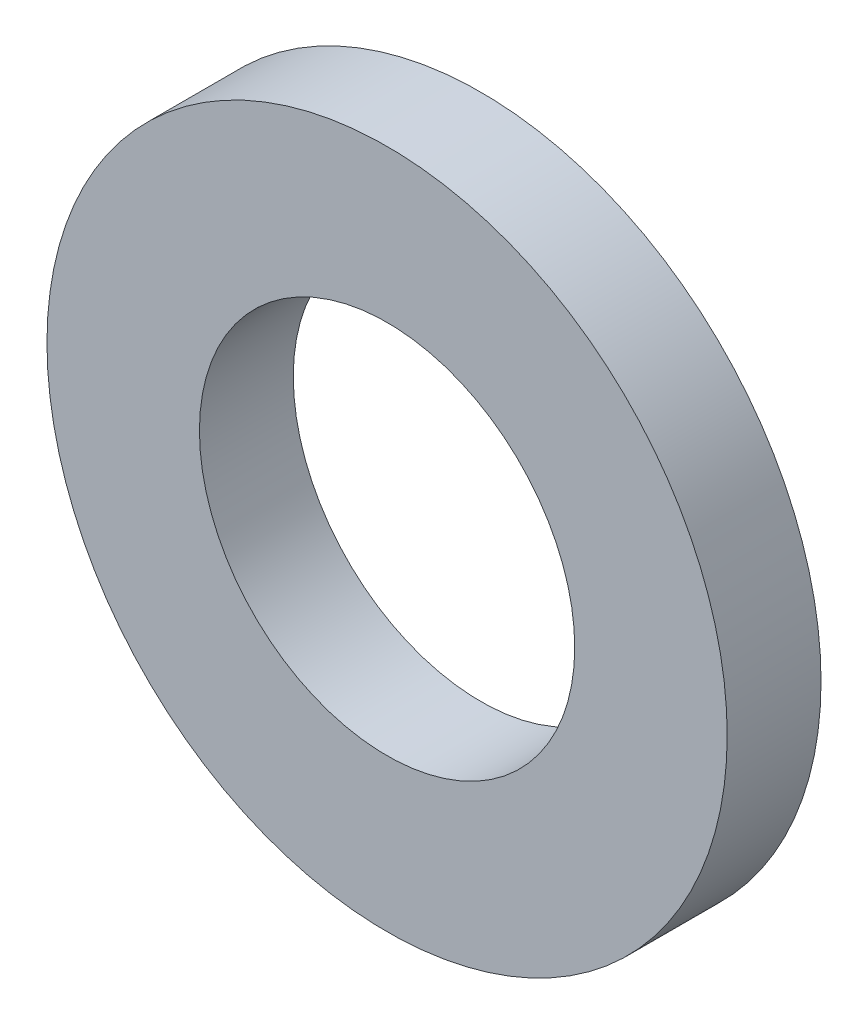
ISO-10303-21;
HEADER;
FILE_DESCRIPTION(('STEP AP214'),'2;1');
FILE_NAME('part.step','',(''),(''),'','','');
FILE_SCHEMA(('AUTOMOTIVE_DESIGN { 1 0 10303 214 1 1 1 1 }'));
ENDSEC;
DATA;
#1=APPLICATION_CONTEXT('core data for automotive mechanical design processes');
#2=APPLICATION_PROTOCOL_DEFINITION('international standard','automotive_design',2000,#1);
#3=PRODUCT_CONTEXT('',#1,'mechanical');
#4=PRODUCT('Part','Part','',(#3));
#5=PRODUCT_RELATED_PRODUCT_CATEGORY('part','',(#4));
#6=PRODUCT_DEFINITION_FORMATION('','',#4);
#7=PRODUCT_DEFINITION_CONTEXT('part definition',#1,'design');
#8=PRODUCT_DEFINITION('design','',#6,#7);
#9=PRODUCT_DEFINITION_SHAPE('','',#8);
#10=(LENGTH_UNIT() NAMED_UNIT(*) SI_UNIT(.MILLI.,.METRE.));
#11=(NAMED_UNIT(*) PLANE_ANGLE_UNIT() SI_UNIT($,.RADIAN.));
#12=(NAMED_UNIT(*) SI_UNIT($,.STERADIAN.) SOLID_ANGLE_UNIT());
#13=UNCERTAINTY_MEASURE_WITH_UNIT(LENGTH_MEASURE(1.E-05),#10,'distance_accuracy_value','');
#14=(GEOMETRIC_REPRESENTATION_CONTEXT(3) GLOBAL_UNCERTAINTY_ASSIGNED_CONTEXT((#13)) GLOBAL_UNIT_ASSIGNED_CONTEXT((#10,
#11,#12)) REPRESENTATION_CONTEXT('',''));
#15=CARTESIAN_POINT('',(0.,0.,0.));
#16=DIRECTION('',(0.,0.,1.));
#17=DIRECTION('',(1.,0.,0.));
#18=AXIS2_PLACEMENT_3D('',#15,#16,#17);
#19=CARTESIAN_POINT('',(0.,0.,0.800000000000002));
#20=DIRECTION('',(0.,0.,1.));
#21=DIRECTION('',(1.,0.,0.));
#22=AXIS2_PLACEMENT_3D('',#19,#20,#21);
#23=PLANE('',#22);
#24=CARTESIAN_POINT('',(0.,0.,0.800000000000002));
#25=DIRECTION('',(0.,0.,1.));
#26=DIRECTION('',(1.,0.,0.));
#27=AXIS2_PLACEMENT_3D('',#24,#25,#26);
#28=CIRCLE('',#27,2.9);
#29=CARTESIAN_POINT('',(2.9,0.,0.800000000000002));
#30=VERTEX_POINT('',#29);
#31=EDGE_CURVE('E10',#30,#30,#28,.T.);
#32=ORIENTED_EDGE('',*,*,#31,.T.);
#33=EDGE_LOOP('',(#32));
#34=FACE_BOUND('',#33,.T.);
#35=CARTESIAN_POINT('',(0.,0.,0.800000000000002));
#36=DIRECTION('',(0.,0.,1.));
#37=DIRECTION('',(1.,0.,0.));
#38=AXIS2_PLACEMENT_3D('',#35,#36,#37);
#39=CIRCLE('',#38,1.6);
#40=CARTESIAN_POINT('',(1.6,0.,0.800000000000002));
#41=VERTEX_POINT('',#40);
#42=EDGE_CURVE('E33',#41,#41,#39,.T.);
#43=ORIENTED_EDGE('',*,*,#42,.F.);
#44=EDGE_LOOP('',(#43));
#45=FACE_BOUND('',#44,.T.);
#46=ADVANCED_FACE('F22',(#34,#45),#23,.T.);
#47=CARTESIAN_POINT('',(0.,0.,0.));
#48=DIRECTION('',(0.,0.,1.));
#49=DIRECTION('',(1.,0.,0.));
#50=AXIS2_PLACEMENT_3D('',#47,#48,#49);
#51=PLANE('',#50);
#52=CARTESIAN_POINT('',(0.,0.,0.));
#53=DIRECTION('',(0.,0.,1.));
#54=DIRECTION('',(1.,0.,0.));
#55=AXIS2_PLACEMENT_3D('',#52,#53,#54);
#56=CIRCLE('',#55,2.9);
#57=CARTESIAN_POINT('',(2.9,0.,0.));
#58=VERTEX_POINT('',#57);
#59=EDGE_CURVE('E29',#58,#58,#56,.T.);
#60=ORIENTED_EDGE('',*,*,#59,.F.);
#61=EDGE_LOOP('',(#60));
#62=FACE_BOUND('',#61,.T.);
#63=CARTESIAN_POINT('',(0.,0.,0.));
#64=DIRECTION('',(0.,0.,1.));
#65=DIRECTION('',(1.,0.,0.));
#66=AXIS2_PLACEMENT_3D('',#63,#64,#65);
#67=CIRCLE('',#66,1.6);
#68=CARTESIAN_POINT('',(1.6,0.,0.));
#69=VERTEX_POINT('',#68);
#70=EDGE_CURVE('E37',#69,#69,#67,.T.);
#71=ORIENTED_EDGE('',*,*,#70,.T.);
#72=EDGE_LOOP('',(#71));
#73=FACE_BOUND('',#72,.T.);
#74=ADVANCED_FACE('F43',(#62,#73),#51,.F.);
#75=CARTESIAN_POINT('',(0.,0.,0.800000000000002));
#76=DIRECTION('',(0.,0.,-1.));
#77=DIRECTION('',(-1.,0.,0.));
#78=AXIS2_PLACEMENT_3D('',#75,#76,#77);
#79=CYLINDRICAL_SURFACE('',#78,2.9);
#80=ORIENTED_EDGE('',*,*,#31,.F.);
#81=EDGE_LOOP('',(#80));
#82=FACE_BOUND('',#81,.T.);
#83=ORIENTED_EDGE('',*,*,#59,.T.);
#84=EDGE_LOOP('',(#83));
#85=FACE_BOUND('',#84,.T.);
#86=ADVANCED_FACE('F24',(#82,#85),#79,.T.);
#87=CARTESIAN_POINT('',(0.,0.,0.800000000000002));
#88=DIRECTION('',(0.,0.,-1.));
#89=DIRECTION('',(-1.,0.,0.));
#90=AXIS2_PLACEMENT_3D('',#87,#88,#89);
#91=CYLINDRICAL_SURFACE('',#90,1.6);
#92=ORIENTED_EDGE('',*,*,#42,.T.);
#93=EDGE_LOOP('',(#92));
#94=FACE_BOUND('',#93,.T.);
#95=ORIENTED_EDGE('',*,*,#70,.F.);
#96=EDGE_LOOP('',(#95));
#97=FACE_BOUND('',#96,.T.);
#98=ADVANCED_FACE('F45',(#94,#97),#91,.F.);
#99=CLOSED_SHELL('',(#46,#74,#86,#98));
#100=MANIFOLD_SOLID_BREP('B2',#99);
#101=ADVANCED_BREP_SHAPE_REPRESENTATION('',(#18,#100),#14);
#102=SHAPE_DEFINITION_REPRESENTATION(#9,#101);
ENDSEC;
END-ISO-10303-21;
